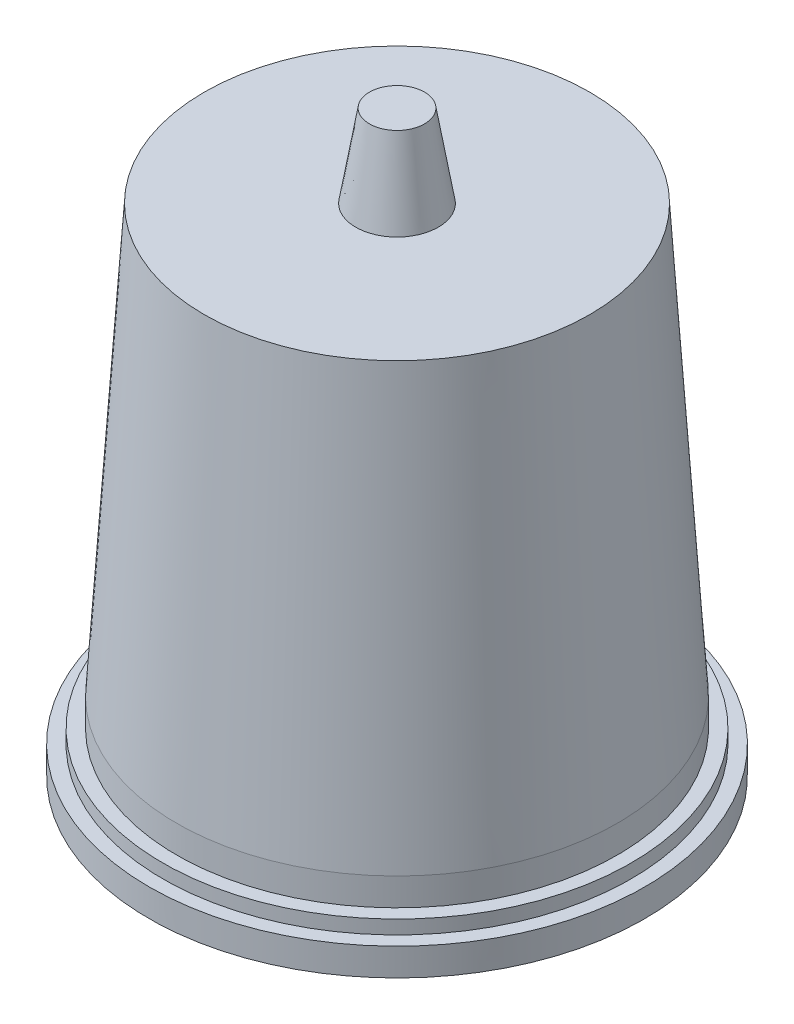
ISO-10303-21;
HEADER;
FILE_DESCRIPTION(('STEP AP214'),'2;1');
FILE_NAME('part.step','',(''),(''),'','','');
FILE_SCHEMA(('AUTOMOTIVE_DESIGN { 1 0 10303 214 1 1 1 1 }'));
ENDSEC;
DATA;
#1=APPLICATION_CONTEXT('core data for automotive mechanical design processes');
#2=APPLICATION_PROTOCOL_DEFINITION('international standard','automotive_design',2000,#1);
#3=PRODUCT_CONTEXT('',#1,'mechanical');
#4=PRODUCT('Part','Part','',(#3));
#5=PRODUCT_RELATED_PRODUCT_CATEGORY('part','',(#4));
#6=PRODUCT_DEFINITION_FORMATION('','',#4);
#7=PRODUCT_DEFINITION_CONTEXT('part definition',#1,'design');
#8=PRODUCT_DEFINITION('design','',#6,#7);
#9=PRODUCT_DEFINITION_SHAPE('','',#8);
#10=(LENGTH_UNIT() NAMED_UNIT(*) SI_UNIT(.MILLI.,.METRE.));
#11=(NAMED_UNIT(*) PLANE_ANGLE_UNIT() SI_UNIT($,.RADIAN.));
#12=(NAMED_UNIT(*) SI_UNIT($,.STERADIAN.) SOLID_ANGLE_UNIT());
#13=UNCERTAINTY_MEASURE_WITH_UNIT(LENGTH_MEASURE(1.E-05),#10,'distance_accuracy_value','');
#14=(GEOMETRIC_REPRESENTATION_CONTEXT(3) GLOBAL_UNCERTAINTY_ASSIGNED_CONTEXT((#13)) GLOBAL_UNIT_ASSIGNED_CONTEXT((#10,
#11,#12)) REPRESENTATION_CONTEXT('',''));
#15=CARTESIAN_POINT('',(0.,0.,0.));
#16=DIRECTION('',(0.,0.,1.));
#17=DIRECTION('',(1.,0.,0.));
#18=AXIS2_PLACEMENT_3D('',#15,#16,#17);
#19=CARTESIAN_POINT('',(0.,205.000000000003,0.));
#20=DIRECTION('',(0.,-1.,0.));
#21=DIRECTION('',(-1.,0.,0.));
#22=AXIS2_PLACEMENT_3D('',#19,#20,#21);
#23=SPHERICAL_SURFACE('',#22,205.000000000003);
#24=CARTESIAN_POINT('',(0.,4.99999999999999,0.));
#25=DIRECTION('',(0.,-1.,0.));
#26=DIRECTION('',(0.,0.,-1.));
#27=AXIS2_PLACEMENT_3D('',#24,#25,#26);
#28=CIRCLE('',#27,45.);
#29=CARTESIAN_POINT('',(38.9711431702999,4.99999999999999,-22.4999999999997));
#30=VERTEX_POINT('',#29);
#31=CARTESIAN_POINT('',(-38.9711431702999,4.99999999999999,-22.4999999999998));
#32=VERTEX_POINT('',#31);
#33=EDGE_CURVE('E156',#30,#32,#28,.T.);
#34=ORIENTED_EDGE('',*,*,#33,.T.);
#35=CARTESIAN_POINT('',(0.,205.000000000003,0.));
#36=DIRECTION('',(-0.499999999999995,0.,0.866025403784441));
#37=DIRECTION('',(0.866025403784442,0.,0.499999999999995));
#38=AXIS2_PLACEMENT_3D('',#35,#36,#37);
#39=CIRCLE('',#38,205.000000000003);
#40=CARTESIAN_POINT('',(-17.3205080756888,0.977942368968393,-9.99999999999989));
#41=VERTEX_POINT('',#40);
#42=EDGE_CURVE('E11',#32,#41,#39,.T.);
#43=ORIENTED_EDGE('',*,*,#42,.T.);
#44=CARTESIAN_POINT('',(0.,0.977942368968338,0.));
#45=DIRECTION('',(0.,1.,0.));
#46=DIRECTION('',(0.,0.,1.));
#47=AXIS2_PLACEMENT_3D('',#44,#45,#46);
#48=CIRCLE('',#47,20.);
#49=CARTESIAN_POINT('',(17.3205080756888,0.977942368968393,-9.99999999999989));
#50=VERTEX_POINT('',#49);
#51=EDGE_CURVE('E49',#41,#50,#48,.F.);
#52=ORIENTED_EDGE('',*,*,#51,.T.);
#53=CARTESIAN_POINT('',(0.,205.000000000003,0.));
#54=DIRECTION('',(0.499999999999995,0.,0.866025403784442));
#55=DIRECTION('',(0.866025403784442,0.,-0.499999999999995));
#56=AXIS2_PLACEMENT_3D('',#53,#54,#55);
#57=CIRCLE('',#56,205.000000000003);
#58=EDGE_CURVE('E205',#50,#30,#57,.T.);
#59=ORIENTED_EDGE('',*,*,#58,.T.);
#60=EDGE_LOOP('',(#34,#43,#52,#59));
#61=FACE_BOUND('',#60,.T.);
#62=ADVANCED_FACE('F41',(#61),#23,.T.);
#63=CARTESIAN_POINT('',(0.,110.,0.));
#64=DIRECTION('',(0.,-1.,0.));
#65=DIRECTION('',(0.,0.,-1.));
#66=AXIS2_PLACEMENT_3D('',#63,#64,#65);
#67=PLANE('',#66);
#68=CARTESIAN_POINT('',(0.,110.,0.));
#69=DIRECTION('',(0.,-1.,0.));
#70=DIRECTION('',(0.,0.,-1.));
#71=AXIS2_PLACEMENT_3D('',#68,#69,#70);
#72=CIRCLE('',#71,5.);
#73=CARTESIAN_POINT('',(0.,110.,-5.));
#74=VERTEX_POINT('',#73);
#75=EDGE_CURVE('E190',#74,#74,#72,.T.);
#76=ORIENTED_EDGE('',*,*,#75,.F.);
#77=EDGE_LOOP('',(#76));
#78=FACE_BOUND('',#77,.T.);
#79=ADVANCED_FACE('F237',(#78),#67,.F.);
#80=CARTESIAN_POINT('',(0.,110.,0.));
#81=DIRECTION('',(0.,-1.,0.));
#82=DIRECTION('',(0.,0.,-1.));
#83=AXIS2_PLACEMENT_3D('',#80,#81,#82);
#84=CONICAL_SURFACE('',#83,5.,0.165148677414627);
#85=CARTESIAN_POINT('',(0.,95.,0.));
#86=DIRECTION('',(0.,-1.,0.));
#87=DIRECTION('',(0.,0.,-1.));
#88=AXIS2_PLACEMENT_3D('',#85,#86,#87);
#89=CIRCLE('',#88,7.5);
#90=CARTESIAN_POINT('',(0.,95.,-7.5));
#91=VERTEX_POINT('',#90);
#92=EDGE_CURVE('E186',#91,#91,#89,.T.);
#93=ORIENTED_EDGE('',*,*,#92,.F.);
#94=EDGE_LOOP('',(#93));
#95=FACE_BOUND('',#94,.T.);
#96=ORIENTED_EDGE('',*,*,#75,.T.);
#97=EDGE_LOOP('',(#96));
#98=FACE_BOUND('',#97,.T.);
#99=ADVANCED_FACE('F242',(#95,#98),#84,.T.);
#100=CARTESIAN_POINT('',(-7.5,95.,0.));
#101=DIRECTION('',(0.,-1.,0.));
#102=DIRECTION('',(0.,0.,-1.));
#103=AXIS2_PLACEMENT_3D('',#100,#101,#102);
#104=PLANE('',#103);
#105=CARTESIAN_POINT('',(0.,95.,0.));
#106=DIRECTION('',(0.,-1.,0.));
#107=DIRECTION('',(0.,0.,-1.));
#108=AXIS2_PLACEMENT_3D('',#105,#106,#107);
#109=CIRCLE('',#108,35.);
#110=CARTESIAN_POINT('',(0.,95.,-35.));
#111=VERTEX_POINT('',#110);
#112=EDGE_CURVE('E182',#111,#111,#109,.T.);
#113=ORIENTED_EDGE('',*,*,#112,.F.);
#114=EDGE_LOOP('',(#113));
#115=FACE_BOUND('',#114,.T.);
#116=ORIENTED_EDGE('',*,*,#92,.T.);
#117=EDGE_LOOP('',(#116));
#118=FACE_BOUND('',#117,.T.);
#119=ADVANCED_FACE('F295',(#115,#118),#104,.F.);
#120=CARTESIAN_POINT('',(0.,95.,0.));
#121=DIRECTION('',(0.,-1.,0.));
#122=DIRECTION('',(0.,0.,-1.));
#123=AXIS2_PLACEMENT_3D('',#120,#121,#122);
#124=CONICAL_SURFACE('',#123,35.,0.0644268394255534);
#125=CARTESIAN_POINT('',(0.,17.5,0.));
#126=DIRECTION('',(0.,-1.,0.));
#127=DIRECTION('',(0.,0.,-1.));
#128=AXIS2_PLACEMENT_3D('',#125,#126,#127);
#129=CIRCLE('',#128,40.);
#130=CARTESIAN_POINT('',(0.,17.5,-40.));
#131=VERTEX_POINT('',#130);
#132=EDGE_CURVE('E178',#131,#131,#129,.T.);
#133=ORIENTED_EDGE('',*,*,#132,.F.);
#134=EDGE_LOOP('',(#133));
#135=FACE_BOUND('',#134,.T.);
#136=ORIENTED_EDGE('',*,*,#112,.T.);
#137=EDGE_LOOP('',(#136));
#138=FACE_BOUND('',#137,.T.);
#139=ADVANCED_FACE('F289',(#135,#138),#124,.T.);
#140=CARTESIAN_POINT('',(0.,0.,0.));
#141=DIRECTION('',(0.,-1.,0.));
#142=DIRECTION('',(0.,0.,-1.));
#143=AXIS2_PLACEMENT_3D('',#140,#141,#142);
#144=CYLINDRICAL_SURFACE('',#143,40.);
#145=CARTESIAN_POINT('',(0.,12.5,0.));
#146=DIRECTION('',(0.,-1.,0.));
#147=DIRECTION('',(0.,0.,-1.));
#148=AXIS2_PLACEMENT_3D('',#145,#146,#147);
#149=CIRCLE('',#148,40.);
#150=CARTESIAN_POINT('',(0.,12.5,-40.));
#151=VERTEX_POINT('',#150);
#152=EDGE_CURVE('E174',#151,#151,#149,.T.);
#153=ORIENTED_EDGE('',*,*,#152,.F.);
#154=EDGE_LOOP('',(#153));
#155=FACE_BOUND('',#154,.T.);
#156=ORIENTED_EDGE('',*,*,#132,.T.);
#157=EDGE_LOOP('',(#156));
#158=FACE_BOUND('',#157,.T.);
#159=ADVANCED_FACE('F294',(#155,#158),#144,.T.);
#160=CARTESIAN_POINT('',(-42.5,12.5,0.));
#161=DIRECTION('',(0.,-1.,0.));
#162=DIRECTION('',(0.,0.,-1.));
#163=AXIS2_PLACEMENT_3D('',#160,#161,#162);
#164=PLANE('',#163);
#165=CARTESIAN_POINT('',(0.,12.5,0.));
#166=DIRECTION('',(0.,-1.,0.));
#167=DIRECTION('',(0.,0.,-1.));
#168=AXIS2_PLACEMENT_3D('',#165,#166,#167);
#169=CIRCLE('',#168,42.5);
#170=CARTESIAN_POINT('',(0.,12.5,-42.5));
#171=VERTEX_POINT('',#170);
#172=EDGE_CURVE('E170',#171,#171,#169,.T.);
#173=ORIENTED_EDGE('',*,*,#172,.F.);
#174=EDGE_LOOP('',(#173));
#175=FACE_BOUND('',#174,.T.);
#176=ORIENTED_EDGE('',*,*,#152,.T.);
#177=EDGE_LOOP('',(#176));
#178=FACE_BOUND('',#177,.T.);
#179=ADVANCED_FACE('F369',(#175,#178),#164,.F.);
#180=CARTESIAN_POINT('',(0.,0.,0.));
#181=DIRECTION('',(0.,-1.,0.));
#182=DIRECTION('',(0.,0.,-1.));
#183=AXIS2_PLACEMENT_3D('',#180,#181,#182);
#184=CYLINDRICAL_SURFACE('',#183,42.5);
#185=CARTESIAN_POINT('',(0.,9.99999999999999,0.));
#186=DIRECTION('',(0.,-1.,0.));
#187=DIRECTION('',(0.,0.,-1.));
#188=AXIS2_PLACEMENT_3D('',#185,#186,#187);
#189=CIRCLE('',#188,42.5);
#190=CARTESIAN_POINT('',(0.,9.99999999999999,-42.5));
#191=VERTEX_POINT('',#190);
#192=EDGE_CURVE('E166',#191,#191,#189,.T.);
#193=ORIENTED_EDGE('',*,*,#192,.F.);
#194=EDGE_LOOP('',(#193));
#195=FACE_BOUND('',#194,.T.);
#196=ORIENTED_EDGE('',*,*,#172,.T.);
#197=EDGE_LOOP('',(#196));
#198=FACE_BOUND('',#197,.T.);
#199=ADVANCED_FACE('F326',(#195,#198),#184,.T.);
#200=CARTESIAN_POINT('',(-45.,9.99999999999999,0.));
#201=DIRECTION('',(0.,-1.,0.));
#202=DIRECTION('',(0.,0.,-1.));
#203=AXIS2_PLACEMENT_3D('',#200,#201,#202);
#204=PLANE('',#203);
#205=CARTESIAN_POINT('',(0.,9.99999999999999,0.));
#206=DIRECTION('',(0.,-1.,0.));
#207=DIRECTION('',(0.,0.,-1.));
#208=AXIS2_PLACEMENT_3D('',#205,#206,#207);
#209=CIRCLE('',#208,45.);
#210=CARTESIAN_POINT('',(0.,9.99999999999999,-45.));
#211=VERTEX_POINT('',#210);
#212=EDGE_CURVE('E162',#211,#211,#209,.T.);
#213=ORIENTED_EDGE('',*,*,#212,.F.);
#214=EDGE_LOOP('',(#213));
#215=FACE_BOUND('',#214,.T.);
#216=ORIENTED_EDGE('',*,*,#192,.T.);
#217=EDGE_LOOP('',(#216));
#218=FACE_BOUND('',#217,.T.);
#219=ADVANCED_FACE('F317',(#215,#218),#204,.F.);
#220=CARTESIAN_POINT('',(0.,0.,0.));
#221=DIRECTION('',(0.,-1.,0.));
#222=DIRECTION('',(0.,0.,-1.));
#223=AXIS2_PLACEMENT_3D('',#220,#221,#222);
#224=CYLINDRICAL_SURFACE('',#223,45.);
#225=ORIENTED_EDGE('',*,*,#33,.F.);
#226=CARTESIAN_POINT('',(0.,4.99999999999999,0.));
#227=DIRECTION('',(0.,1.,0.));
#228=DIRECTION('',(0.,0.,1.));
#229=AXIS2_PLACEMENT_3D('',#226,#227,#228);
#230=CIRCLE('',#229,45.);
#231=EDGE_CURVE('E146',#30,#32,#230,.T.);
#232=ORIENTED_EDGE('',*,*,#231,.T.);
#233=EDGE_LOOP('',(#225,#232));
#234=FACE_BOUND('',#233,.T.);
#235=ORIENTED_EDGE('',*,*,#212,.T.);
#236=EDGE_LOOP('',(#235));
#237=FACE_BOUND('',#236,.T.);
#238=ADVANCED_FACE('F219',(#234,#237),#224,.T.);
#239=CARTESIAN_POINT('',(0.,0.,0.));
#240=DIRECTION('',(0.,1.,0.));
#241=DIRECTION('',(0.,0.,1.));
#242=AXIS2_PLACEMENT_3D('',#239,#240,#241);
#243=CYLINDRICAL_SURFACE('',#242,20.);
#244=DIRECTION('',(0.,1.,0.));
#245=VECTOR('',#244,1.);
#246=CARTESIAN_POINT('',(-17.3205080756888,0.,-9.9999999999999));
#247=LINE('',#246,#245);
#248=CARTESIAN_POINT('',(-17.3205080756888,4.99999999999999,-9.9999999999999));
#249=VERTEX_POINT('',#248);
#250=EDGE_CURVE('E153',#41,#249,#247,.T.);
#251=ORIENTED_EDGE('',*,*,#250,.T.);
#252=CARTESIAN_POINT('',(0.,4.99999999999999,0.));
#253=DIRECTION('',(0.,-1.,0.));
#254=DIRECTION('',(0.,0.,1.));
#255=AXIS2_PLACEMENT_3D('',#252,#253,#254);
#256=CIRCLE('',#255,20.);
#257=CARTESIAN_POINT('',(17.3205080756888,4.99999999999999,-9.99999999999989));
#258=VERTEX_POINT('',#257);
#259=EDGE_CURVE('E134',#249,#258,#256,.T.);
#260=ORIENTED_EDGE('',*,*,#259,.T.);
#261=DIRECTION('',(0.,1.,0.));
#262=VECTOR('',#261,1.);
#263=CARTESIAN_POINT('',(17.3205080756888,0.,-9.99999999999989));
#264=LINE('',#263,#262);
#265=EDGE_CURVE('E152',#50,#258,#264,.T.);
#266=ORIENTED_EDGE('',*,*,#265,.F.);
#267=ORIENTED_EDGE('',*,*,#51,.F.);
#268=EDGE_LOOP('',(#251,#260,#266,#267));
#269=FACE_BOUND('',#268,.T.);
#270=ADVANCED_FACE('F215',(#269),#243,.T.);
#271=CARTESIAN_POINT('',(-17.3205080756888,0.,-9.9999999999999));
#272=DIRECTION('',(-0.499999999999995,0.,0.866025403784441));
#273=DIRECTION('',(0.866025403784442,0.,0.499999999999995));
#274=AXIS2_PLACEMENT_3D('',#271,#272,#273);
#275=PLANE('',#274);
#276=DIRECTION('',(0.866025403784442,0.,0.499999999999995));
#277=VECTOR('',#276,1.);
#278=CARTESIAN_POINT('',(-17.3205080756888,4.99999999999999,-9.9999999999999));
#279=LINE('',#278,#277);
#280=EDGE_CURVE('E64',#32,#249,#279,.T.);
#281=ORIENTED_EDGE('',*,*,#280,.T.);
#282=ORIENTED_EDGE('',*,*,#250,.F.);
#283=ORIENTED_EDGE('',*,*,#42,.F.);
#284=EDGE_LOOP('',(#281,#282,#283));
#285=FACE_BOUND('',#284,.T.);
#286=ADVANCED_FACE('F217',(#285),#275,.F.);
#287=CARTESIAN_POINT('',(17.3205080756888,0.,-9.99999999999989));
#288=DIRECTION('',(0.499999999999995,0.,0.866025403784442));
#289=DIRECTION('',(0.866025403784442,0.,-0.499999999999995));
#290=AXIS2_PLACEMENT_3D('',#287,#288,#289);
#291=PLANE('',#290);
#292=ORIENTED_EDGE('',*,*,#265,.T.);
#293=DIRECTION('',(0.866025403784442,0.,-0.499999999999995));
#294=VECTOR('',#293,1.);
#295=CARTESIAN_POINT('',(17.3205080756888,4.99999999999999,-9.99999999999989));
#296=LINE('',#295,#294);
#297=EDGE_CURVE('E142',#258,#30,#296,.T.);
#298=ORIENTED_EDGE('',*,*,#297,.T.);
#299=ORIENTED_EDGE('',*,*,#58,.F.);
#300=EDGE_LOOP('',(#292,#298,#299));
#301=FACE_BOUND('',#300,.T.);
#302=ADVANCED_FACE('F223',(#301),#291,.F.);
#303=CARTESIAN_POINT('',(0.,0.,0.));
#304=DIRECTION('',(0.,1.,0.));
#305=DIRECTION('',(0.,0.,1.));
#306=AXIS2_PLACEMENT_3D('',#303,#304,#305);
#307=CYLINDRICAL_SURFACE('',#306,20.5);
#308=CARTESIAN_POINT('',(0.,1.02757539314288,0.));
#309=DIRECTION('',(0.,1.,0.));
#310=DIRECTION('',(0.,0.,1.));
#311=AXIS2_PLACEMENT_3D('',#308,#309,#310);
#312=CIRCLE('',#311,20.5);
#313=CARTESIAN_POINT('',(-17.4982393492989,1.02757539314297,-10.6799634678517));
#314=VERTEX_POINT('',#313);
#315=CARTESIAN_POINT('',(17.4982393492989,1.02757539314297,-10.6799634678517));
#316=VERTEX_POINT('',#315);
#317=EDGE_CURVE('E202',#314,#316,#312,.F.);
#318=ORIENTED_EDGE('',*,*,#317,.T.);
#319=DIRECTION('',(0.,1.,0.));
#320=VECTOR('',#319,1.);
#321=CARTESIAN_POINT('',(17.4982393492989,0.,-10.6799634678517));
#322=LINE('',#321,#320);
#323=CARTESIAN_POINT('',(17.4982393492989,4.99999999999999,-10.6799634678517));
#324=VERTEX_POINT('',#323);
#325=EDGE_CURVE('E56',#316,#324,#322,.T.);
#326=ORIENTED_EDGE('',*,*,#325,.T.);
#327=CARTESIAN_POINT('',(0.,4.99999999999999,0.));
#328=DIRECTION('',(0.,-1.,0.));
#329=DIRECTION('',(0.,0.,1.));
#330=AXIS2_PLACEMENT_3D('',#327,#328,#329);
#331=CIRCLE('',#330,20.5);
#332=CARTESIAN_POINT('',(-17.4982393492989,4.99999999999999,-10.6799634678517));
#333=VERTEX_POINT('',#332);
#334=EDGE_CURVE('E119',#333,#324,#331,.T.);
#335=ORIENTED_EDGE('',*,*,#334,.F.);
#336=DIRECTION('',(0.,1.,0.));
#337=VECTOR('',#336,1.);
#338=CARTESIAN_POINT('',(-17.4982393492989,0.,-10.6799634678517));
#339=LINE('',#338,#337);
#340=EDGE_CURVE('E131',#314,#333,#339,.T.);
#341=ORIENTED_EDGE('',*,*,#340,.F.);
#342=EDGE_LOOP('',(#318,#326,#335,#341));
#343=FACE_BOUND('',#342,.T.);
#344=ADVANCED_FACE('F225',(#343),#307,.F.);
#345=CARTESIAN_POINT('',(-17.4982393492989,0.,-10.6799634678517));
#346=DIRECTION('',(-0.5,0.,0.866025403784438));
#347=DIRECTION('',(0.866025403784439,0.,0.5));
#348=AXIS2_PLACEMENT_3D('',#345,#346,#347);
#349=PLANE('',#348);
#350=CARTESIAN_POINT('',(0.249999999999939,205.000000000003,-0.433012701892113));
#351=DIRECTION('',(-0.5,0.,0.866025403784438));
#352=DIRECTION('',(0.866025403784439,0.,0.5));
#353=AXIS2_PLACEMENT_3D('',#350,#351,#352);
#354=CIRCLE('',#353,204.999390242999);
#355=CARTESIAN_POINT('',(-38.2856977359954,4.88815627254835,-22.6816081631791));
#356=VERTEX_POINT('',#355);
#357=EDGE_CURVE('E199',#356,#314,#354,.T.);
#358=ORIENTED_EDGE('',*,*,#357,.T.);
#359=ORIENTED_EDGE('',*,*,#340,.T.);
#360=DIRECTION('',(0.866025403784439,0.,0.5));
#361=VECTOR('',#360,1.);
#362=CARTESIAN_POINT('',(-17.4982393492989,4.99999999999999,-10.6799634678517));
#363=LINE('',#362,#361);
#364=CARTESIAN_POINT('',(-38.2856977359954,4.99999999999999,-22.6816081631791));
#365=VERTEX_POINT('',#364);
#366=EDGE_CURVE('E125',#365,#333,#363,.T.);
#367=ORIENTED_EDGE('',*,*,#366,.F.);
#368=DIRECTION('',(0.,1.,0.));
#369=VECTOR('',#368,1.);
#370=CARTESIAN_POINT('',(-38.2856977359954,0.,-22.6816081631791));
#371=LINE('',#370,#369);
#372=EDGE_CURVE('E109',#356,#365,#371,.T.);
#373=ORIENTED_EDGE('',*,*,#372,.F.);
#374=EDGE_LOOP('',(#358,#359,#367,#373));
#375=FACE_BOUND('',#374,.T.);
#376=ADVANCED_FACE('F231',(#375),#349,.T.);
#377=CARTESIAN_POINT('',(0.,0.,0.));
#378=DIRECTION('',(0.,1.,0.));
#379=DIRECTION('',(0.,0.,1.));
#380=AXIS2_PLACEMENT_3D('',#377,#378,#379);
#381=CYLINDRICAL_SURFACE('',#380,44.5);
#382=CARTESIAN_POINT('',(0.,4.88815627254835,0.));
#383=DIRECTION('',(0.,1.,0.));
#384=DIRECTION('',(0.,0.,1.));
#385=AXIS2_PLACEMENT_3D('',#382,#383,#384);
#386=CIRCLE('',#385,44.5);
#387=CARTESIAN_POINT('',(38.2856977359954,4.88815627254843,-22.6816081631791));
#388=VERTEX_POINT('',#387);
#389=EDGE_CURVE('E196',#388,#356,#386,.T.);
#390=ORIENTED_EDGE('',*,*,#389,.T.);
#391=ORIENTED_EDGE('',*,*,#372,.T.);
#392=CARTESIAN_POINT('',(0.,4.99999999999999,0.));
#393=DIRECTION('',(0.,1.,0.));
#394=DIRECTION('',(0.,0.,1.));
#395=AXIS2_PLACEMENT_3D('',#392,#393,#394);
#396=CIRCLE('',#395,44.5);
#397=CARTESIAN_POINT('',(38.2856977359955,4.99999999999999,-22.6816081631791));
#398=VERTEX_POINT('',#397);
#399=EDGE_CURVE('E116',#398,#365,#396,.T.);
#400=ORIENTED_EDGE('',*,*,#399,.F.);
#401=DIRECTION('',(0.,1.,0.));
#402=VECTOR('',#401,1.);
#403=CARTESIAN_POINT('',(38.2856977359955,0.,-22.6816081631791));
#404=LINE('',#403,#402);
#405=EDGE_CURVE('E99',#388,#398,#404,.T.);
#406=ORIENTED_EDGE('',*,*,#405,.F.);
#407=EDGE_LOOP('',(#390,#391,#400,#406));
#408=FACE_BOUND('',#407,.T.);
#409=ADVANCED_FACE('F122',(#408),#381,.T.);
#410=CARTESIAN_POINT('',(17.4982393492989,0.,-10.6799634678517));
#411=DIRECTION('',(0.5,0.,0.866025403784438));
#412=DIRECTION('',(0.866025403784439,0.,-0.5));
#413=AXIS2_PLACEMENT_3D('',#410,#411,#412);
#414=PLANE('',#413);
#415=CARTESIAN_POINT('',(-0.249999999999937,205.000000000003,-0.43301270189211));
#416=DIRECTION('',(0.5,0.,0.866025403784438));
#417=DIRECTION('',(0.866025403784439,0.,-0.5));
#418=AXIS2_PLACEMENT_3D('',#415,#416,#417);
#419=CIRCLE('',#418,204.999390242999);
#420=EDGE_CURVE('E104',#316,#388,#419,.T.);
#421=ORIENTED_EDGE('',*,*,#420,.T.);
#422=ORIENTED_EDGE('',*,*,#405,.T.);
#423=DIRECTION('',(0.866025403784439,0.,-0.5));
#424=VECTOR('',#423,1.);
#425=CARTESIAN_POINT('',(17.4982393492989,4.99999999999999,-10.6799634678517));
#426=LINE('',#425,#424);
#427=EDGE_CURVE('E102',#324,#398,#426,.T.);
#428=ORIENTED_EDGE('',*,*,#427,.F.);
#429=ORIENTED_EDGE('',*,*,#325,.F.);
#430=EDGE_LOOP('',(#421,#422,#428,#429));
#431=FACE_BOUND('',#430,.T.);
#432=ADVANCED_FACE('F101',(#431),#414,.T.);
#433=CARTESIAN_POINT('',(0.,4.99999999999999,0.));
#434=DIRECTION('',(0.,1.,0.));
#435=DIRECTION('',(0.,0.,1.));
#436=AXIS2_PLACEMENT_3D('',#433,#434,#435);
#437=PLANE('',#436);
#438=ORIENTED_EDGE('',*,*,#334,.T.);
#439=ORIENTED_EDGE('',*,*,#427,.T.);
#440=ORIENTED_EDGE('',*,*,#399,.T.);
#441=ORIENTED_EDGE('',*,*,#366,.T.);
#442=EDGE_LOOP('',(#438,#439,#440,#441));
#443=FACE_BOUND('',#442,.T.);
#444=ORIENTED_EDGE('',*,*,#259,.F.);
#445=ORIENTED_EDGE('',*,*,#280,.F.);
#446=ORIENTED_EDGE('',*,*,#231,.F.);
#447=ORIENTED_EDGE('',*,*,#297,.F.);
#448=EDGE_LOOP('',(#444,#445,#446,#447));
#449=FACE_BOUND('',#448,.T.);
#450=ADVANCED_FACE('F114',(#443,#449),#437,.F.);
#451=ORIENTED_EDGE('',*,*,#317,.F.);
#452=ORIENTED_EDGE('',*,*,#357,.F.);
#453=ORIENTED_EDGE('',*,*,#389,.F.);
#454=ORIENTED_EDGE('',*,*,#420,.F.);
#455=EDGE_LOOP('',(#451,#452,#453,#454));
#456=FACE_BOUND('',#455,.T.);
#457=ADVANCED_FACE('F238',(#456),#23,.T.);
#458=CLOSED_SHELL('',(#62,#79,#99,#119,#139,#159,#179,#199,#219,#238,#270,#286,#302,#344,#376,
#409,#432,#450,#457));
#459=MANIFOLD_SOLID_BREP('B2',#458);
#460=ADVANCED_BREP_SHAPE_REPRESENTATION('',(#18,#459),#14);
#461=SHAPE_DEFINITION_REPRESENTATION(#9,#460);
ENDSEC;
END-ISO-10303-21;
